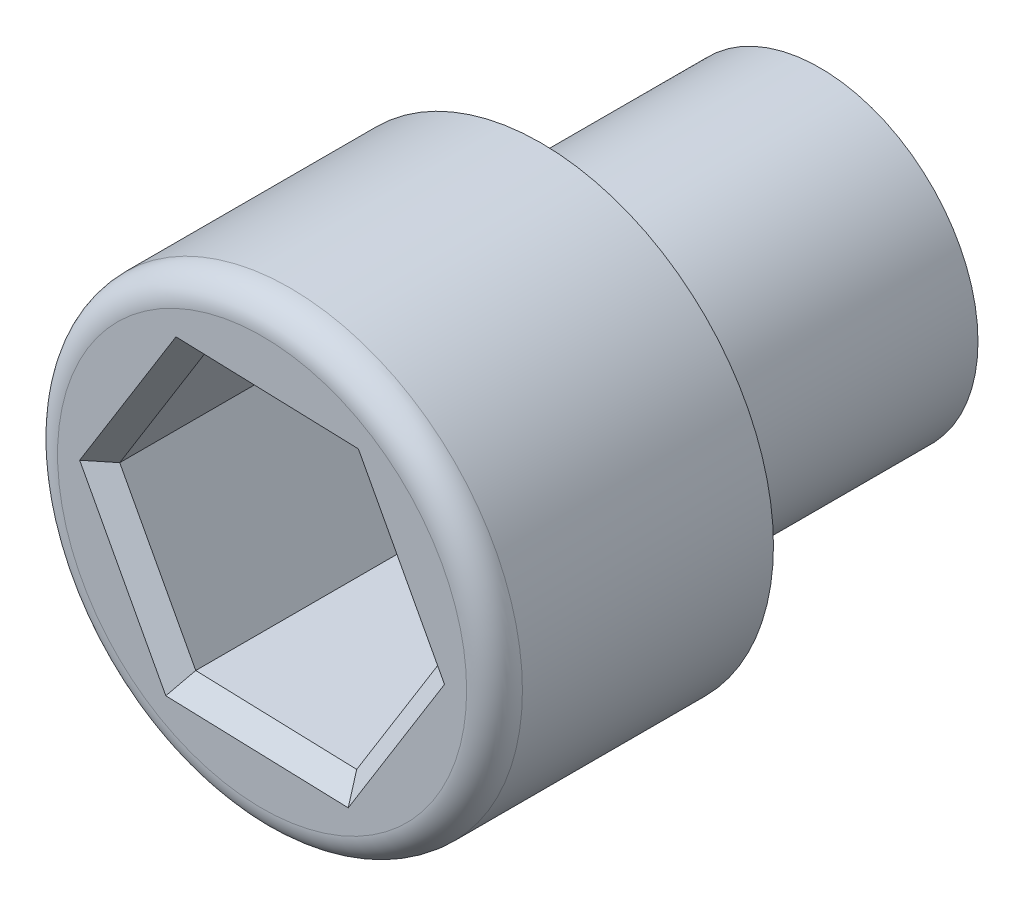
from build123d import *

# Parameters (mm, degrees)
SZKIC1_R                    = 1.7
DODANIE_WYCI_GNI_CIE1_DEPTH = 3
SZKIC2_R                    = 2.5
DODANIE_WYCI_GNI_CIE2_DEPTH = 3
ZAOKR_GLENIE1_R             = 0.3
WYTNIJ_WYCI_GNI_CIE1_DEPTH  = 3
SFAZOWANIE1_SIZE            = 0.2


with BuildPart() as part:
    # Szkic1 → Dodanie-wyci_gni_cie1 (new body)
    with BuildSketch(Plane.XY):
        Circle(SZKIC1_R)
    extrude(amount=DODANIE_WYCI_GNI_CIE1_DEPTH)

    # Szkic2 → Dodanie-wyci_gni_cie2 (add)
    with BuildSketch(Plane.XY.offset(3)):
        Circle(SZKIC2_R)
    extrude(amount=DODANIE_WYCI_GNI_CIE2_DEPTH)

    # Zaokr_glenie1
    zaokr_glenie1_edges = [part.edges().sort_by_distance(p)[0] for p in [
        (-2.5, 0, 6),
    ]]
    fillet(zaokr_glenie1_edges, radius=ZAOKR_GLENIE1_R)

    # Szkic3 → Wytnij-wyci_gni_cie1 (cut)
    with BuildSketch(Plane.XY.offset(6)):
        Polygon((-0.817437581, 1.527021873), (-1.731158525, 0.055589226), (-0.913720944, -1.471432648), (0.817437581, -1.527021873), (1.731158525, -0.055589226), (0.913720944, 1.471432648), align=None)
    extrude(amount=-WYTNIJ_WYCI_GNI_CIE1_DEPTH, mode=Mode.SUBTRACT)

    # Sfazowanie1
    sfazowanie1_edges = [part.edges().sort_by_distance(p)[0] for p in [
        (0.048141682, 1.49922726, 6),
        (-1.274298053, 0.79130555, 6),
        (-1.322439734, -0.707921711, 6),
        (-0.048141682, -1.49922726, 6),
        (1.274298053, -0.79130555, 6),
        (1.322439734, 0.707921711, 6),
    ]]
    chamfer(sfazowanie1_edges, length=SFAZOWANIE1_SIZE)


solid = part.part
